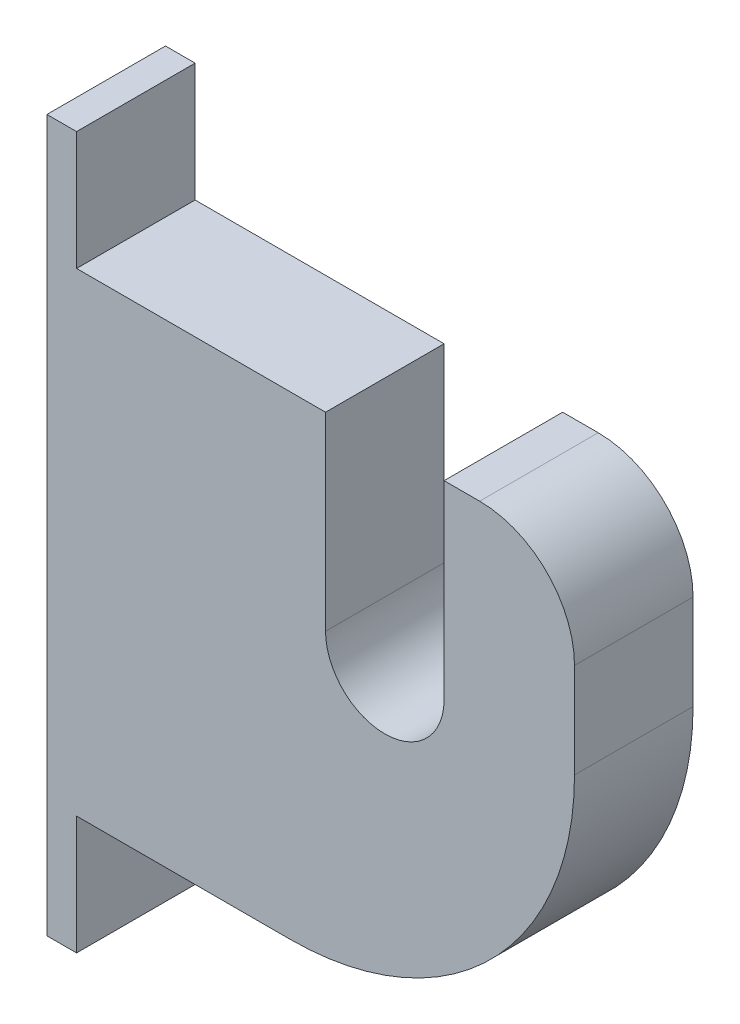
ISO-10303-21;
HEADER;
FILE_DESCRIPTION(('STEP AP214'),'2;1');
FILE_NAME('part.step','',(''),(''),'','','');
FILE_SCHEMA(('AUTOMOTIVE_DESIGN { 1 0 10303 214 1 1 1 1 }'));
ENDSEC;
DATA;
#1=APPLICATION_CONTEXT('core data for automotive mechanical design processes');
#2=APPLICATION_PROTOCOL_DEFINITION('international standard','automotive_design',2000,#1);
#3=PRODUCT_CONTEXT('',#1,'mechanical');
#4=PRODUCT('Part','Part','',(#3));
#5=PRODUCT_RELATED_PRODUCT_CATEGORY('part','',(#4));
#6=PRODUCT_DEFINITION_FORMATION('','',#4);
#7=PRODUCT_DEFINITION_CONTEXT('part definition',#1,'design');
#8=PRODUCT_DEFINITION('design','',#6,#7);
#9=PRODUCT_DEFINITION_SHAPE('','',#8);
#10=(LENGTH_UNIT() NAMED_UNIT(*) SI_UNIT(.MILLI.,.METRE.));
#11=(NAMED_UNIT(*) PLANE_ANGLE_UNIT() SI_UNIT($,.RADIAN.));
#12=(NAMED_UNIT(*) SI_UNIT($,.STERADIAN.) SOLID_ANGLE_UNIT());
#13=UNCERTAINTY_MEASURE_WITH_UNIT(LENGTH_MEASURE(1.E-05),#10,'distance_accuracy_value','');
#14=(GEOMETRIC_REPRESENTATION_CONTEXT(3) GLOBAL_UNCERTAINTY_ASSIGNED_CONTEXT((#13)) GLOBAL_UNIT_ASSIGNED_CONTEXT((#10,
#11,#12)) REPRESENTATION_CONTEXT('',''));
#15=CARTESIAN_POINT('',(0.,0.,0.));
#16=DIRECTION('',(0.,0.,1.));
#17=DIRECTION('',(1.,0.,0.));
#18=AXIS2_PLACEMENT_3D('',#15,#16,#17);
#19=CARTESIAN_POINT('',(81.12125,-6.35000000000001,3.175));
#20=DIRECTION('',(1.,0.,0.));
#21=DIRECTION('',(0.,0.,-1.));
#22=AXIS2_PLACEMENT_3D('',#19,#20,#21);
#23=PLANE('',#22);
#24=DIRECTION('',(0.,-1.,0.));
#25=VECTOR('',#24,1.);
#26=CARTESIAN_POINT('',(81.12125,-6.35000000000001,0.));
#27=LINE('',#26,#25);
#28=CARTESIAN_POINT('',(81.12125,9.52499999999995,0.));
#29=VERTEX_POINT('',#28);
#30=CARTESIAN_POINT('',(81.12125,-9.52500000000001,0.));
#31=VERTEX_POINT('',#30);
#32=EDGE_CURVE('E102',#29,#31,#27,.T.);
#33=ORIENTED_EDGE('',*,*,#32,.T.);
#34=DIRECTION('',(0.,0.,-1.));
#35=VECTOR('',#34,1.);
#36=CARTESIAN_POINT('',(81.12125,-9.52500000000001,3.175));
#37=LINE('',#36,#35);
#38=CARTESIAN_POINT('',(81.12125,-9.52500000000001,3.175));
#39=VERTEX_POINT('',#38);
#40=EDGE_CURVE('E11',#39,#31,#37,.T.);
#41=ORIENTED_EDGE('',*,*,#40,.F.);
#42=DIRECTION('',(0.,-1.,0.));
#43=VECTOR('',#42,1.);
#44=CARTESIAN_POINT('',(81.12125,6.34999999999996,3.175));
#45=LINE('',#44,#43);
#46=CARTESIAN_POINT('',(81.12125,9.52499999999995,3.175));
#47=VERTEX_POINT('',#46);
#48=EDGE_CURVE('E108',#47,#39,#45,.T.);
#49=ORIENTED_EDGE('',*,*,#48,.F.);
#50=DIRECTION('',(0.,0.,-1.));
#51=VECTOR('',#50,1.);
#52=CARTESIAN_POINT('',(81.12125,9.52499999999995,3.175));
#53=LINE('',#52,#51);
#54=EDGE_CURVE('E159',#47,#29,#53,.T.);
#55=ORIENTED_EDGE('',*,*,#54,.T.);
#56=EDGE_LOOP('',(#33,#41,#49,#55));
#57=FACE_BOUND('',#56,.T.);
#58=ADVANCED_FACE('F32',(#57),#23,.F.);
#59=CARTESIAN_POINT('',(81.12125,-9.52500000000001,3.175));
#60=DIRECTION('',(0.,1.,0.));
#61=DIRECTION('',(0.,0.,1.));
#62=AXIS2_PLACEMENT_3D('',#59,#60,#61);
#63=PLANE('',#62);
#64=DIRECTION('',(1.,0.,0.));
#65=VECTOR('',#64,1.);
#66=CARTESIAN_POINT('',(81.12125,-9.52500000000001,0.));
#67=LINE('',#66,#65);
#68=CARTESIAN_POINT('',(81.915,-9.52500000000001,0.));
#69=VERTEX_POINT('',#68);
#70=EDGE_CURVE('E164',#31,#69,#67,.T.);
#71=ORIENTED_EDGE('',*,*,#70,.T.);
#72=DIRECTION('',(0.,0.,-1.));
#73=VECTOR('',#72,1.);
#74=CARTESIAN_POINT('',(81.915,-9.52500000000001,3.175));
#75=LINE('',#74,#73);
#76=CARTESIAN_POINT('',(81.915,-9.52500000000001,3.175));
#77=VERTEX_POINT('',#76);
#78=EDGE_CURVE('E40',#77,#69,#75,.T.);
#79=ORIENTED_EDGE('',*,*,#78,.F.);
#80=DIRECTION('',(1.,0.,0.));
#81=VECTOR('',#80,1.);
#82=CARTESIAN_POINT('',(81.12125,-9.52500000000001,3.175));
#83=LINE('',#82,#81);
#84=EDGE_CURVE('E268',#39,#77,#83,.T.);
#85=ORIENTED_EDGE('',*,*,#84,.F.);
#86=ORIENTED_EDGE('',*,*,#40,.T.);
#87=EDGE_LOOP('',(#71,#79,#85,#86));
#88=FACE_BOUND('',#87,.T.);
#89=ADVANCED_FACE('F271',(#88),#63,.F.);
#90=CARTESIAN_POINT('',(81.915,-6.35000000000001,3.175));
#91=DIRECTION('',(-1.,0.,0.));
#92=DIRECTION('',(0.,0.,1.));
#93=AXIS2_PLACEMENT_3D('',#90,#91,#92);
#94=PLANE('',#93);
#95=DIRECTION('',(0.,1.,0.));
#96=VECTOR('',#95,1.);
#97=CARTESIAN_POINT('',(81.915,-6.35000000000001,0.));
#98=LINE('',#97,#96);
#99=CARTESIAN_POINT('',(81.915,-6.35000000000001,0.));
#100=VERTEX_POINT('',#99);
#101=EDGE_CURVE('E166',#69,#100,#98,.T.);
#102=ORIENTED_EDGE('',*,*,#101,.T.);
#103=DIRECTION('',(0.,0.,-1.));
#104=VECTOR('',#103,1.);
#105=CARTESIAN_POINT('',(81.915,-6.35000000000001,3.175));
#106=LINE('',#105,#104);
#107=CARTESIAN_POINT('',(81.915,-6.35000000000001,3.175));
#108=VERTEX_POINT('',#107);
#109=EDGE_CURVE('E214',#108,#100,#106,.T.);
#110=ORIENTED_EDGE('',*,*,#109,.F.);
#111=DIRECTION('',(0.,1.,0.));
#112=VECTOR('',#111,1.);
#113=CARTESIAN_POINT('',(81.915,-6.35000000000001,3.175));
#114=LINE('',#113,#112);
#115=EDGE_CURVE('E223',#77,#108,#114,.T.);
#116=ORIENTED_EDGE('',*,*,#115,.F.);
#117=ORIENTED_EDGE('',*,*,#78,.T.);
#118=EDGE_LOOP('',(#102,#110,#116,#117));
#119=FACE_BOUND('',#118,.T.);
#120=ADVANCED_FACE('F221',(#119),#94,.F.);
#121=CARTESIAN_POINT('',(81.915,-6.35000000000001,3.175));
#122=DIRECTION('',(0.,1.,0.));
#123=DIRECTION('',(0.,0.,1.));
#124=AXIS2_PLACEMENT_3D('',#121,#122,#123);
#125=PLANE('',#124);
#126=DIRECTION('',(1.,0.,0.));
#127=VECTOR('',#126,1.);
#128=CARTESIAN_POINT('',(81.915,-6.35000000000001,0.));
#129=LINE('',#128,#127);
#130=CARTESIAN_POINT('',(87.63,-6.35000000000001,0.));
#131=VERTEX_POINT('',#130);
#132=EDGE_CURVE('E168',#100,#131,#129,.T.);
#133=ORIENTED_EDGE('',*,*,#132,.T.);
#134=DIRECTION('',(0.,0.,-1.));
#135=VECTOR('',#134,1.);
#136=CARTESIAN_POINT('',(87.63,-6.35000000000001,3.175));
#137=LINE('',#136,#135);
#138=CARTESIAN_POINT('',(87.63,-6.35000000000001,3.175));
#139=VERTEX_POINT('',#138);
#140=EDGE_CURVE('E211',#139,#131,#137,.T.);
#141=ORIENTED_EDGE('',*,*,#140,.F.);
#142=DIRECTION('',(1.,0.,0.));
#143=VECTOR('',#142,1.);
#144=CARTESIAN_POINT('',(81.915,-6.35000000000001,3.175));
#145=LINE('',#144,#143);
#146=EDGE_CURVE('E241',#108,#139,#145,.T.);
#147=ORIENTED_EDGE('',*,*,#146,.F.);
#148=ORIENTED_EDGE('',*,*,#109,.T.);
#149=EDGE_LOOP('',(#133,#141,#147,#148));
#150=FACE_BOUND('',#149,.T.);
#151=ADVANCED_FACE('F232',(#150),#125,.F.);
#152=CARTESIAN_POINT('',(87.63,1.26999999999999,3.175));
#153=DIRECTION('',(0.,0.,-1.));
#154=DIRECTION('',(-1.,0.,0.));
#155=AXIS2_PLACEMENT_3D('',#152,#153,#154);
#156=CYLINDRICAL_SURFACE('',#155,7.61999999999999);
#157=CARTESIAN_POINT('',(87.63,1.26999999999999,0.));
#158=DIRECTION('',(0.,0.,1.));
#159=DIRECTION('',(1.,0.,0.));
#160=AXIS2_PLACEMENT_3D('',#157,#158,#159);
#161=CIRCLE('',#160,7.61999999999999);
#162=CARTESIAN_POINT('',(95.25,1.27000000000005,0.));
#163=VERTEX_POINT('',#162);
#164=EDGE_CURVE('E170',#131,#163,#161,.T.);
#165=ORIENTED_EDGE('',*,*,#164,.T.);
#166=DIRECTION('',(0.,0.,-1.));
#167=VECTOR('',#166,1.);
#168=CARTESIAN_POINT('',(95.25,1.27000000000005,3.175));
#169=LINE('',#168,#167);
#170=CARTESIAN_POINT('',(95.25,1.27000000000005,3.175));
#171=VERTEX_POINT('',#170);
#172=EDGE_CURVE('E208',#171,#163,#169,.T.);
#173=ORIENTED_EDGE('',*,*,#172,.F.);
#174=CARTESIAN_POINT('',(87.63,1.26999999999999,3.175));
#175=DIRECTION('',(0.,0.,1.));
#176=DIRECTION('',(1.,0.,0.));
#177=AXIS2_PLACEMENT_3D('',#174,#175,#176);
#178=CIRCLE('',#177,7.61999999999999);
#179=EDGE_CURVE('E238',#139,#171,#178,.T.);
#180=ORIENTED_EDGE('',*,*,#179,.F.);
#181=ORIENTED_EDGE('',*,*,#140,.T.);
#182=EDGE_LOOP('',(#165,#173,#180,#181));
#183=FACE_BOUND('',#182,.T.);
#184=ADVANCED_FACE('F236',(#183),#156,.T.);
#185=CARTESIAN_POINT('',(95.25,1.27000000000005,3.175));
#186=DIRECTION('',(-1.,0.,0.));
#187=DIRECTION('',(0.,0.,1.));
#188=AXIS2_PLACEMENT_3D('',#185,#186,#187);
#189=PLANE('',#188);
#190=DIRECTION('',(0.,1.,0.));
#191=VECTOR('',#190,1.);
#192=CARTESIAN_POINT('',(95.25,1.27000000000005,0.));
#193=LINE('',#192,#191);
#194=CARTESIAN_POINT('',(95.25,3.80999999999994,0.));
#195=VERTEX_POINT('',#194);
#196=EDGE_CURVE('E172',#163,#195,#193,.T.);
#197=ORIENTED_EDGE('',*,*,#196,.T.);
#198=DIRECTION('',(0.,0.,-1.));
#199=VECTOR('',#198,1.);
#200=CARTESIAN_POINT('',(95.25,3.80999999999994,3.175));
#201=LINE('',#200,#199);
#202=CARTESIAN_POINT('',(95.25,3.80999999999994,3.175));
#203=VERTEX_POINT('',#202);
#204=EDGE_CURVE('E205',#203,#195,#201,.T.);
#205=ORIENTED_EDGE('',*,*,#204,.F.);
#206=DIRECTION('',(0.,1.,0.));
#207=VECTOR('',#206,1.);
#208=CARTESIAN_POINT('',(95.25,1.27000000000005,3.175));
#209=LINE('',#208,#207);
#210=EDGE_CURVE('E240',#171,#203,#209,.T.);
#211=ORIENTED_EDGE('',*,*,#210,.F.);
#212=ORIENTED_EDGE('',*,*,#172,.T.);
#213=EDGE_LOOP('',(#197,#205,#211,#212));
#214=FACE_BOUND('',#213,.T.);
#215=ADVANCED_FACE('F283',(#214),#189,.F.);
#216=CARTESIAN_POINT('',(92.71,3.80999999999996,3.175));
#217=DIRECTION('',(0.,0.,-1.));
#218=DIRECTION('',(-1.,0.,0.));
#219=AXIS2_PLACEMENT_3D('',#216,#217,#218);
#220=CYLINDRICAL_SURFACE('',#219,2.54);
#221=CARTESIAN_POINT('',(92.71,3.80999999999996,0.));
#222=DIRECTION('',(0.,0.,1.));
#223=DIRECTION('',(-1.,0.,0.));
#224=AXIS2_PLACEMENT_3D('',#221,#222,#223);
#225=CIRCLE('',#224,2.54);
#226=CARTESIAN_POINT('',(92.71,6.34999999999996,0.));
#227=VERTEX_POINT('',#226);
#228=EDGE_CURVE('E174',#195,#227,#225,.T.);
#229=ORIENTED_EDGE('',*,*,#228,.T.);
#230=DIRECTION('',(0.,0.,-1.));
#231=VECTOR('',#230,1.);
#232=CARTESIAN_POINT('',(92.71,6.34999999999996,3.175));
#233=LINE('',#232,#231);
#234=CARTESIAN_POINT('',(92.71,6.34999999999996,3.175));
#235=VERTEX_POINT('',#234);
#236=EDGE_CURVE('E202',#235,#227,#233,.T.);
#237=ORIENTED_EDGE('',*,*,#236,.F.);
#238=CARTESIAN_POINT('',(92.71,3.80999999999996,3.175));
#239=DIRECTION('',(0.,0.,1.));
#240=DIRECTION('',(-1.,0.,0.));
#241=AXIS2_PLACEMENT_3D('',#238,#239,#240);
#242=CIRCLE('',#241,2.54);
#243=EDGE_CURVE('E243',#203,#235,#242,.T.);
#244=ORIENTED_EDGE('',*,*,#243,.F.);
#245=ORIENTED_EDGE('',*,*,#204,.T.);
#246=EDGE_LOOP('',(#229,#237,#244,#245));
#247=FACE_BOUND('',#246,.T.);
#248=ADVANCED_FACE('F286',(#247),#220,.T.);
#249=CARTESIAN_POINT('',(92.71,6.34999999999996,3.175));
#250=DIRECTION('',(0.,-1.,0.));
#251=DIRECTION('',(0.,0.,-1.));
#252=AXIS2_PLACEMENT_3D('',#249,#250,#251);
#253=PLANE('',#252);
#254=DIRECTION('',(-1.,0.,0.));
#255=VECTOR('',#254,1.);
#256=CARTESIAN_POINT('',(92.71,6.34999999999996,0.));
#257=LINE('',#256,#255);
#258=CARTESIAN_POINT('',(91.7575,6.34999999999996,0.));
#259=VERTEX_POINT('',#258);
#260=EDGE_CURVE('E176',#227,#259,#257,.T.);
#261=ORIENTED_EDGE('',*,*,#260,.T.);
#262=DIRECTION('',(0.,0.,-1.));
#263=VECTOR('',#262,1.);
#264=CARTESIAN_POINT('',(91.7575,6.34999999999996,3.175));
#265=LINE('',#264,#263);
#266=CARTESIAN_POINT('',(91.7575,6.34999999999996,3.175));
#267=VERTEX_POINT('',#266);
#268=EDGE_CURVE('E199',#267,#259,#265,.T.);
#269=ORIENTED_EDGE('',*,*,#268,.F.);
#270=DIRECTION('',(-1.,0.,0.));
#271=VECTOR('',#270,1.);
#272=CARTESIAN_POINT('',(92.71,6.34999999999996,3.175));
#273=LINE('',#272,#271);
#274=EDGE_CURVE('E249',#235,#267,#273,.T.);
#275=ORIENTED_EDGE('',*,*,#274,.F.);
#276=ORIENTED_EDGE('',*,*,#236,.T.);
#277=EDGE_LOOP('',(#261,#269,#275,#276));
#278=FACE_BOUND('',#277,.T.);
#279=ADVANCED_FACE('F290',(#278),#253,.F.);
#280=CARTESIAN_POINT('',(91.7575,6.34999999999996,3.175));
#281=DIRECTION('',(1.,0.,0.));
#282=DIRECTION('',(0.,0.,-1.));
#283=AXIS2_PLACEMENT_3D('',#280,#281,#282);
#284=PLANE('',#283);
#285=DIRECTION('',(0.,-1.,0.));
#286=VECTOR('',#285,1.);
#287=CARTESIAN_POINT('',(91.7575,6.34999999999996,0.));
#288=LINE('',#287,#286);
#289=CARTESIAN_POINT('',(91.7575,1.26999999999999,0.));
#290=VERTEX_POINT('',#289);
#291=EDGE_CURVE('E178',#259,#290,#288,.T.);
#292=ORIENTED_EDGE('',*,*,#291,.T.);
#293=DIRECTION('',(0.,0.,-1.));
#294=VECTOR('',#293,1.);
#295=CARTESIAN_POINT('',(91.7575,1.26999999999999,3.175));
#296=LINE('',#295,#294);
#297=CARTESIAN_POINT('',(91.7575,1.26999999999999,3.175));
#298=VERTEX_POINT('',#297);
#299=EDGE_CURVE('E196',#298,#290,#296,.T.);
#300=ORIENTED_EDGE('',*,*,#299,.F.);
#301=DIRECTION('',(0.,-1.,0.));
#302=VECTOR('',#301,1.);
#303=CARTESIAN_POINT('',(91.7575,6.34999999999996,3.175));
#304=LINE('',#303,#302);
#305=EDGE_CURVE('E251',#267,#298,#304,.T.);
#306=ORIENTED_EDGE('',*,*,#305,.F.);
#307=ORIENTED_EDGE('',*,*,#268,.T.);
#308=EDGE_LOOP('',(#292,#300,#306,#307));
#309=FACE_BOUND('',#308,.T.);
#310=ADVANCED_FACE('F294',(#309),#284,.F.);
#311=CARTESIAN_POINT('',(90.17,1.26999999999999,3.175));
#312=DIRECTION('',(0.,0.,-1.));
#313=DIRECTION('',(-1.,0.,0.));
#314=AXIS2_PLACEMENT_3D('',#311,#312,#313);
#315=CYLINDRICAL_SURFACE('',#314,1.58750000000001);
#316=CARTESIAN_POINT('',(90.17,1.26999999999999,0.));
#317=DIRECTION('',(0.,0.,-1.));
#318=DIRECTION('',(1.,0.,0.));
#319=AXIS2_PLACEMENT_3D('',#316,#317,#318);
#320=CIRCLE('',#319,1.58750000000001);
#321=CARTESIAN_POINT('',(88.5825,1.26999999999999,0.));
#322=VERTEX_POINT('',#321);
#323=EDGE_CURVE('E180',#290,#322,#320,.T.);
#324=ORIENTED_EDGE('',*,*,#323,.T.);
#325=DIRECTION('',(0.,0.,-1.));
#326=VECTOR('',#325,1.);
#327=CARTESIAN_POINT('',(88.5825,1.26999999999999,3.175));
#328=LINE('',#327,#326);
#329=CARTESIAN_POINT('',(88.5825,1.26999999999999,3.175));
#330=VERTEX_POINT('',#329);
#331=EDGE_CURVE('E193',#330,#322,#328,.T.);
#332=ORIENTED_EDGE('',*,*,#331,.F.);
#333=CARTESIAN_POINT('',(90.17,1.26999999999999,3.175));
#334=DIRECTION('',(0.,0.,-1.));
#335=DIRECTION('',(1.,0.,0.));
#336=AXIS2_PLACEMENT_3D('',#333,#334,#335);
#337=CIRCLE('',#336,1.58750000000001);
#338=EDGE_CURVE('E253',#298,#330,#337,.T.);
#339=ORIENTED_EDGE('',*,*,#338,.F.);
#340=ORIENTED_EDGE('',*,*,#299,.T.);
#341=EDGE_LOOP('',(#324,#332,#339,#340));
#342=FACE_BOUND('',#341,.T.);
#343=ADVANCED_FACE('F259',(#342),#315,.F.);
#344=CARTESIAN_POINT('',(88.5825,6.34999999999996,3.175));
#345=DIRECTION('',(-1.,0.,0.));
#346=DIRECTION('',(0.,0.,1.));
#347=AXIS2_PLACEMENT_3D('',#344,#345,#346);
#348=PLANE('',#347);
#349=DIRECTION('',(0.,1.,0.));
#350=VECTOR('',#349,1.);
#351=CARTESIAN_POINT('',(88.5825,6.34999999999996,0.));
#352=LINE('',#351,#350);
#353=CARTESIAN_POINT('',(88.5825,6.34999999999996,0.));
#354=VERTEX_POINT('',#353);
#355=EDGE_CURVE('E182',#322,#354,#352,.T.);
#356=ORIENTED_EDGE('',*,*,#355,.T.);
#357=DIRECTION('',(0.,0.,-1.));
#358=VECTOR('',#357,1.);
#359=CARTESIAN_POINT('',(88.5825,6.34999999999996,3.175));
#360=LINE('',#359,#358);
#361=CARTESIAN_POINT('',(88.5825,6.34999999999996,3.175));
#362=VERTEX_POINT('',#361);
#363=EDGE_CURVE('E154',#362,#354,#360,.T.);
#364=ORIENTED_EDGE('',*,*,#363,.F.);
#365=DIRECTION('',(0.,1.,0.));
#366=VECTOR('',#365,1.);
#367=CARTESIAN_POINT('',(88.5825,6.34999999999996,3.175));
#368=LINE('',#367,#366);
#369=EDGE_CURVE('E146',#330,#362,#368,.T.);
#370=ORIENTED_EDGE('',*,*,#369,.F.);
#371=ORIENTED_EDGE('',*,*,#331,.T.);
#372=EDGE_LOOP('',(#356,#364,#370,#371));
#373=FACE_BOUND('',#372,.T.);
#374=ADVANCED_FACE('F263',(#373),#348,.F.);
#375=CARTESIAN_POINT('',(85.09,6.34999999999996,3.175));
#376=DIRECTION('',(0.,-1.,0.));
#377=DIRECTION('',(1.,0.,0.));
#378=AXIS2_PLACEMENT_3D('',#375,#376,#377);
#379=PLANE('',#378);
#380=DIRECTION('',(-1.,0.,0.));
#381=VECTOR('',#380,1.);
#382=CARTESIAN_POINT('',(85.09,6.34999999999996,0.));
#383=LINE('',#382,#381);
#384=CARTESIAN_POINT('',(81.915,6.34999999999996,0.));
#385=VERTEX_POINT('',#384);
#386=EDGE_CURVE('E153',#354,#385,#383,.T.);
#387=ORIENTED_EDGE('',*,*,#386,.T.);
#388=DIRECTION('',(0.,0.,-1.));
#389=VECTOR('',#388,1.);
#390=CARTESIAN_POINT('',(81.915,6.34999999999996,3.175));
#391=LINE('',#390,#389);
#392=CARTESIAN_POINT('',(81.915,6.34999999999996,3.175));
#393=VERTEX_POINT('',#392);
#394=EDGE_CURVE('E151',#393,#385,#391,.T.);
#395=ORIENTED_EDGE('',*,*,#394,.F.);
#396=DIRECTION('',(-1.,0.,0.));
#397=VECTOR('',#396,1.);
#398=CARTESIAN_POINT('',(88.5825,6.34999999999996,3.175));
#399=LINE('',#398,#397);
#400=EDGE_CURVE('E140',#362,#393,#399,.T.);
#401=ORIENTED_EDGE('',*,*,#400,.F.);
#402=ORIENTED_EDGE('',*,*,#363,.T.);
#403=EDGE_LOOP('',(#387,#395,#401,#402));
#404=FACE_BOUND('',#403,.T.);
#405=ADVANCED_FACE('F152',(#404),#379,.F.);
#406=CARTESIAN_POINT('',(81.915,6.34999999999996,3.175));
#407=DIRECTION('',(-1.,0.,0.));
#408=DIRECTION('',(0.,0.,1.));
#409=AXIS2_PLACEMENT_3D('',#406,#407,#408);
#410=PLANE('',#409);
#411=DIRECTION('',(0.,1.,0.));
#412=VECTOR('',#411,1.);
#413=CARTESIAN_POINT('',(81.915,6.34999999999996,0.));
#414=LINE('',#413,#412);
#415=CARTESIAN_POINT('',(81.915,9.52499999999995,0.));
#416=VERTEX_POINT('',#415);
#417=EDGE_CURVE('E95',#385,#416,#414,.T.);
#418=ORIENTED_EDGE('',*,*,#417,.T.);
#419=DIRECTION('',(0.,0.,-1.));
#420=VECTOR('',#419,1.);
#421=CARTESIAN_POINT('',(81.915,9.52499999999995,3.175));
#422=LINE('',#421,#420);
#423=CARTESIAN_POINT('',(81.915,9.52499999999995,3.175));
#424=VERTEX_POINT('',#423);
#425=EDGE_CURVE('E155',#424,#416,#422,.T.);
#426=ORIENTED_EDGE('',*,*,#425,.F.);
#427=DIRECTION('',(0.,1.,0.));
#428=VECTOR('',#427,1.);
#429=CARTESIAN_POINT('',(81.915,6.34999999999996,3.175));
#430=LINE('',#429,#428);
#431=EDGE_CURVE('E144',#393,#424,#430,.T.);
#432=ORIENTED_EDGE('',*,*,#431,.F.);
#433=ORIENTED_EDGE('',*,*,#394,.T.);
#434=EDGE_LOOP('',(#418,#426,#432,#433));
#435=FACE_BOUND('',#434,.T.);
#436=ADVANCED_FACE('F157',(#435),#410,.F.);
#437=CARTESIAN_POINT('',(81.915,9.52499999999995,3.175));
#438=DIRECTION('',(0.,-1.,0.));
#439=DIRECTION('',(0.,0.,-1.));
#440=AXIS2_PLACEMENT_3D('',#437,#438,#439);
#441=PLANE('',#440);
#442=DIRECTION('',(-1.,0.,0.));
#443=VECTOR('',#442,1.);
#444=CARTESIAN_POINT('',(81.915,9.52499999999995,0.));
#445=LINE('',#444,#443);
#446=EDGE_CURVE('E187',#416,#29,#445,.T.);
#447=ORIENTED_EDGE('',*,*,#446,.T.);
#448=ORIENTED_EDGE('',*,*,#54,.F.);
#449=DIRECTION('',(-1.,0.,0.));
#450=VECTOR('',#449,1.);
#451=CARTESIAN_POINT('',(81.915,9.52499999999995,3.175));
#452=LINE('',#451,#450);
#453=EDGE_CURVE('E48',#424,#47,#452,.T.);
#454=ORIENTED_EDGE('',*,*,#453,.F.);
#455=ORIENTED_EDGE('',*,*,#425,.T.);
#456=EDGE_LOOP('',(#447,#448,#454,#455));
#457=FACE_BOUND('',#456,.T.);
#458=ADVANCED_FACE('F266',(#457),#441,.F.);
#459=CARTESIAN_POINT('',(90.17,1.26999999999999,3.175));
#460=DIRECTION('',(0.,0.,1.));
#461=DIRECTION('',(1.,0.,0.));
#462=AXIS2_PLACEMENT_3D('',#459,#460,#461);
#463=PLANE('',#462);
#464=ORIENTED_EDGE('',*,*,#48,.T.);
#465=ORIENTED_EDGE('',*,*,#84,.T.);
#466=ORIENTED_EDGE('',*,*,#115,.T.);
#467=ORIENTED_EDGE('',*,*,#146,.T.);
#468=ORIENTED_EDGE('',*,*,#179,.T.);
#469=ORIENTED_EDGE('',*,*,#210,.T.);
#470=ORIENTED_EDGE('',*,*,#243,.T.);
#471=ORIENTED_EDGE('',*,*,#274,.T.);
#472=ORIENTED_EDGE('',*,*,#305,.T.);
#473=ORIENTED_EDGE('',*,*,#338,.T.);
#474=ORIENTED_EDGE('',*,*,#369,.T.);
#475=ORIENTED_EDGE('',*,*,#400,.T.);
#476=ORIENTED_EDGE('',*,*,#431,.T.);
#477=ORIENTED_EDGE('',*,*,#453,.T.);
#478=EDGE_LOOP('',(#464,#465,#466,#467,#468,#469,#470,#471,#472,#473,#474,#475,#476,#477));
#479=FACE_BOUND('',#478,.T.);
#480=ADVANCED_FACE('F142',(#479),#463,.T.);
#481=CARTESIAN_POINT('',(90.17,1.26999999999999,0.));
#482=DIRECTION('',(0.,0.,1.));
#483=DIRECTION('',(1.,0.,0.));
#484=AXIS2_PLACEMENT_3D('',#481,#482,#483);
#485=PLANE('',#484);
#486=ORIENTED_EDGE('',*,*,#32,.F.);
#487=ORIENTED_EDGE('',*,*,#446,.F.);
#488=ORIENTED_EDGE('',*,*,#417,.F.);
#489=ORIENTED_EDGE('',*,*,#386,.F.);
#490=ORIENTED_EDGE('',*,*,#355,.F.);
#491=ORIENTED_EDGE('',*,*,#323,.F.);
#492=ORIENTED_EDGE('',*,*,#291,.F.);
#493=ORIENTED_EDGE('',*,*,#260,.F.);
#494=ORIENTED_EDGE('',*,*,#228,.F.);
#495=ORIENTED_EDGE('',*,*,#196,.F.);
#496=ORIENTED_EDGE('',*,*,#164,.F.);
#497=ORIENTED_EDGE('',*,*,#132,.F.);
#498=ORIENTED_EDGE('',*,*,#101,.F.);
#499=ORIENTED_EDGE('',*,*,#70,.F.);
#500=EDGE_LOOP('',(#486,#487,#488,#489,#490,#491,#492,#493,#494,#495,#496,#497,#498,#499));
#501=FACE_BOUND('',#500,.T.);
#502=ADVANCED_FACE('F227',(#501),#485,.F.);
#503=CLOSED_SHELL('',(#58,#89,#120,#151,#184,#215,#248,#279,#310,#343,#374,#405,#436,#458,#480,#502));
#504=MANIFOLD_SOLID_BREP('B2',#503);
#505=ADVANCED_BREP_SHAPE_REPRESENTATION('',(#18,#504),#14);
#506=SHAPE_DEFINITION_REPRESENTATION(#9,#505);
ENDSEC;
END-ISO-10303-21;
